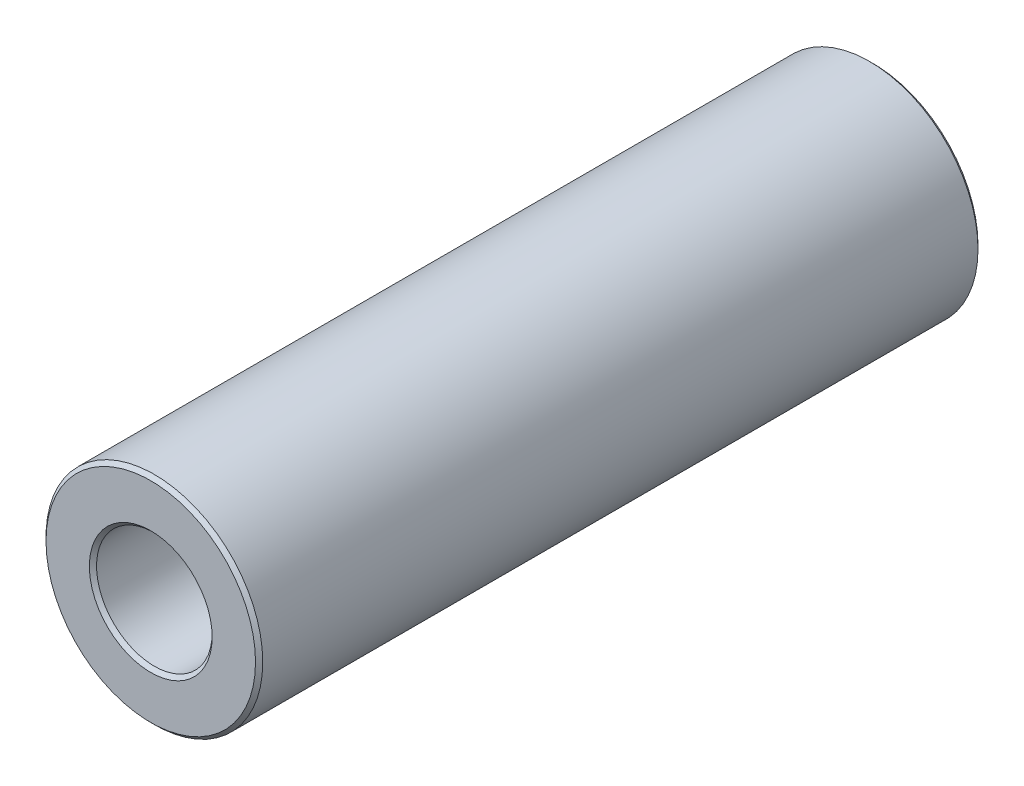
ISO-10303-21;
HEADER;
FILE_DESCRIPTION(('STEP AP214'),'2;1');
FILE_NAME('part.step','',(''),(''),'','','');
FILE_SCHEMA(('AUTOMOTIVE_DESIGN { 1 0 10303 214 1 1 1 1 }'));
ENDSEC;
DATA;
#1=APPLICATION_CONTEXT('core data for automotive mechanical design processes');
#2=APPLICATION_PROTOCOL_DEFINITION('international standard','automotive_design',2000,#1);
#3=PRODUCT_CONTEXT('',#1,'mechanical');
#4=PRODUCT('Part','Part','',(#3));
#5=PRODUCT_RELATED_PRODUCT_CATEGORY('part','',(#4));
#6=PRODUCT_DEFINITION_FORMATION('','',#4);
#7=PRODUCT_DEFINITION_CONTEXT('part definition',#1,'design');
#8=PRODUCT_DEFINITION('design','',#6,#7);
#9=PRODUCT_DEFINITION_SHAPE('','',#8);
#10=(LENGTH_UNIT() NAMED_UNIT(*) SI_UNIT(.MILLI.,.METRE.));
#11=(NAMED_UNIT(*) PLANE_ANGLE_UNIT() SI_UNIT($,.RADIAN.));
#12=(NAMED_UNIT(*) SI_UNIT($,.STERADIAN.) SOLID_ANGLE_UNIT());
#13=UNCERTAINTY_MEASURE_WITH_UNIT(LENGTH_MEASURE(1.E-05),#10,'distance_accuracy_value','');
#14=(GEOMETRIC_REPRESENTATION_CONTEXT(3) GLOBAL_UNCERTAINTY_ASSIGNED_CONTEXT((#13)) GLOBAL_UNIT_ASSIGNED_CONTEXT((#10,
#11,#12)) REPRESENTATION_CONTEXT('',''));
#15=CARTESIAN_POINT('',(0.,0.,0.));
#16=DIRECTION('',(0.,0.,1.));
#17=DIRECTION('',(1.,0.,0.));
#18=AXIS2_PLACEMENT_3D('',#15,#16,#17);
#19=CARTESIAN_POINT('',(0.,0.,10.));
#20=DIRECTION('',(0.,0.,1.));
#21=DIRECTION('',(1.,0.,0.));
#22=AXIS2_PLACEMENT_3D('',#19,#20,#21);
#23=PLANE('',#22);
#24=CARTESIAN_POINT('',(0.,0.,10.));
#25=DIRECTION('',(0.,0.,1.));
#26=DIRECTION('',(1.,0.,0.));
#27=AXIS2_PLACEMENT_3D('',#24,#25,#26);
#28=CIRCLE('',#27,1.70000000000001);
#29=CARTESIAN_POINT('',(1.70000000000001,0.,10.));
#30=VERTEX_POINT('',#29);
#31=EDGE_CURVE('E10',#30,#30,#28,.F.);
#32=ORIENTED_EDGE('',*,*,#31,.T.);
#33=EDGE_LOOP('',(#32));
#34=FACE_BOUND('',#33,.T.);
#35=CARTESIAN_POINT('',(0.,0.,10.));
#36=DIRECTION('',(0.,0.,1.));
#37=DIRECTION('',(1.,0.,0.));
#38=AXIS2_PLACEMENT_3D('',#35,#36,#37);
#39=CIRCLE('',#38,2.9);
#40=CARTESIAN_POINT('',(2.9,0.,10.));
#41=VERTEX_POINT('',#40);
#42=EDGE_CURVE('E45',#41,#41,#39,.T.);
#43=ORIENTED_EDGE('',*,*,#42,.T.);
#44=EDGE_LOOP('',(#43));
#45=FACE_BOUND('',#44,.T.);
#46=ADVANCED_FACE('F37',(#34,#45),#23,.T.);
#47=CARTESIAN_POINT('',(0.,0.,-10.));
#48=DIRECTION('',(0.,0.,1.));
#49=DIRECTION('',(1.,0.,0.));
#50=AXIS2_PLACEMENT_3D('',#47,#48,#49);
#51=PLANE('',#50);
#52=CARTESIAN_POINT('',(0.,0.,-10.));
#53=DIRECTION('',(0.,0.,1.));
#54=DIRECTION('',(1.,0.,0.));
#55=AXIS2_PLACEMENT_3D('',#52,#53,#54);
#56=CIRCLE('',#55,2.9);
#57=CARTESIAN_POINT('',(2.9,0.,-10.));
#58=VERTEX_POINT('',#57);
#59=EDGE_CURVE('E63',#58,#58,#56,.F.);
#60=ORIENTED_EDGE('',*,*,#59,.T.);
#61=EDGE_LOOP('',(#60));
#62=FACE_BOUND('',#61,.T.);
#63=CARTESIAN_POINT('',(0.,0.,-10.));
#64=DIRECTION('',(0.,0.,1.));
#65=DIRECTION('',(1.,0.,0.));
#66=AXIS2_PLACEMENT_3D('',#63,#64,#65);
#67=CIRCLE('',#66,1.7);
#68=CARTESIAN_POINT('',(1.7,0.,-10.));
#69=VERTEX_POINT('',#68);
#70=EDGE_CURVE('E67',#69,#69,#67,.T.);
#71=ORIENTED_EDGE('',*,*,#70,.T.);
#72=EDGE_LOOP('',(#71));
#73=FACE_BOUND('',#72,.T.);
#74=ADVANCED_FACE('F89',(#62,#73),#51,.F.);
#75=CARTESIAN_POINT('',(0.,0.,10.));
#76=DIRECTION('',(0.,0.,-1.));
#77=DIRECTION('',(-1.,0.,0.));
#78=AXIS2_PLACEMENT_3D('',#75,#76,#77);
#79=CYLINDRICAL_SURFACE('',#78,3.);
#80=CARTESIAN_POINT('',(0.,0.,-9.9));
#81=DIRECTION('',(0.,0.,1.));
#82=DIRECTION('',(1.,0.,0.));
#83=AXIS2_PLACEMENT_3D('',#80,#81,#82);
#84=CIRCLE('',#83,3.);
#85=CARTESIAN_POINT('',(3.,0.,-9.9));
#86=VERTEX_POINT('',#85);
#87=EDGE_CURVE('E70',#86,#86,#84,.T.);
#88=ORIENTED_EDGE('',*,*,#87,.T.);
#89=EDGE_LOOP('',(#88));
#90=FACE_BOUND('',#89,.T.);
#91=CARTESIAN_POINT('',(0.,0.,9.9));
#92=DIRECTION('',(0.,0.,1.));
#93=DIRECTION('',(1.,0.,0.));
#94=AXIS2_PLACEMENT_3D('',#91,#92,#93);
#95=CIRCLE('',#94,3.);
#96=CARTESIAN_POINT('',(3.,0.,9.9));
#97=VERTEX_POINT('',#96);
#98=EDGE_CURVE('E74',#97,#97,#95,.F.);
#99=ORIENTED_EDGE('',*,*,#98,.T.);
#100=EDGE_LOOP('',(#99));
#101=FACE_BOUND('',#100,.T.);
#102=ADVANCED_FACE('F78',(#90,#101),#79,.T.);
#103=CARTESIAN_POINT('',(0.,0.,10.));
#104=DIRECTION('',(0.,0.,-1.));
#105=DIRECTION('',(-1.,0.,0.));
#106=AXIS2_PLACEMENT_3D('',#103,#104,#105);
#107=CYLINDRICAL_SURFACE('',#106,1.6);
#108=CARTESIAN_POINT('',(0.,0.,-9.9));
#109=DIRECTION('',(0.,0.,1.));
#110=DIRECTION('',(1.,0.,0.));
#111=AXIS2_PLACEMENT_3D('',#108,#109,#110);
#112=CIRCLE('',#111,1.6);
#113=CARTESIAN_POINT('',(1.6,0.,-9.9));
#114=VERTEX_POINT('',#113);
#115=EDGE_CURVE('E52',#114,#114,#112,.F.);
#116=ORIENTED_EDGE('',*,*,#115,.T.);
#117=EDGE_LOOP('',(#116));
#118=FACE_BOUND('',#117,.T.);
#119=CARTESIAN_POINT('',(0.,0.,9.89999999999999));
#120=DIRECTION('',(0.,0.,1.));
#121=DIRECTION('',(1.,0.,0.));
#122=AXIS2_PLACEMENT_3D('',#119,#120,#121);
#123=CIRCLE('',#122,1.6);
#124=CARTESIAN_POINT('',(1.6,0.,9.89999999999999));
#125=VERTEX_POINT('',#124);
#126=EDGE_CURVE('E58',#125,#125,#123,.T.);
#127=ORIENTED_EDGE('',*,*,#126,.T.);
#128=EDGE_LOOP('',(#127));
#129=FACE_BOUND('',#128,.T.);
#130=ADVANCED_FACE('F97',(#118,#129),#107,.F.);
#131=CARTESIAN_POINT('',(0.,0.,-9.9));
#132=DIRECTION('',(0.,0.,1.));
#133=DIRECTION('',(1.,0.,0.));
#134=AXIS2_PLACEMENT_3D('',#131,#132,#133);
#135=CONICAL_SURFACE('',#134,3.,0.785398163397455);
#136=ORIENTED_EDGE('',*,*,#59,.F.);
#137=EDGE_LOOP('',(#136));
#138=FACE_BOUND('',#137,.T.);
#139=ORIENTED_EDGE('',*,*,#87,.F.);
#140=EDGE_LOOP('',(#139));
#141=FACE_BOUND('',#140,.T.);
#142=ADVANCED_FACE('F102',(#138,#141),#135,.T.);
#143=CARTESIAN_POINT('',(0.,0.,-10.));
#144=DIRECTION('',(0.,0.,-1.));
#145=DIRECTION('',(-1.,0.,0.));
#146=AXIS2_PLACEMENT_3D('',#143,#144,#145);
#147=CONICAL_SURFACE('',#146,1.7,0.78539816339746);
#148=ORIENTED_EDGE('',*,*,#115,.F.);
#149=EDGE_LOOP('',(#148));
#150=FACE_BOUND('',#149,.T.);
#151=ORIENTED_EDGE('',*,*,#70,.F.);
#152=EDGE_LOOP('',(#151));
#153=FACE_BOUND('',#152,.T.);
#154=ADVANCED_FACE('F86',(#150,#153),#147,.F.);
#155=CARTESIAN_POINT('',(0.,0.,9.89999999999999));
#156=DIRECTION('',(0.,0.,1.));
#157=DIRECTION('',(1.,0.,0.));
#158=AXIS2_PLACEMENT_3D('',#155,#156,#157);
#159=CONICAL_SURFACE('',#158,1.6,0.785398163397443);
#160=ORIENTED_EDGE('',*,*,#31,.F.);
#161=EDGE_LOOP('',(#160));
#162=FACE_BOUND('',#161,.T.);
#163=ORIENTED_EDGE('',*,*,#126,.F.);
#164=EDGE_LOOP('',(#163));
#165=FACE_BOUND('',#164,.T.);
#166=ADVANCED_FACE('F82',(#162,#165),#159,.F.);
#167=CARTESIAN_POINT('',(0.,0.,10.));
#168=DIRECTION('',(0.,0.,-1.));
#169=DIRECTION('',(-1.,0.,0.));
#170=AXIS2_PLACEMENT_3D('',#167,#168,#169);
#171=CONICAL_SURFACE('',#170,2.9,0.78539816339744);
#172=ORIENTED_EDGE('',*,*,#98,.F.);
#173=EDGE_LOOP('',(#172));
#174=FACE_BOUND('',#173,.T.);
#175=ORIENTED_EDGE('',*,*,#42,.F.);
#176=EDGE_LOOP('',(#175));
#177=FACE_BOUND('',#176,.T.);
#178=ADVANCED_FACE('F39',(#174,#177),#171,.T.);
#179=CLOSED_SHELL('',(#46,#74,#102,#130,#142,#154,#166,#178));
#180=MANIFOLD_SOLID_BREP('B2',#179);
#181=ADVANCED_BREP_SHAPE_REPRESENTATION('',(#18,#180),#14);
#182=SHAPE_DEFINITION_REPRESENTATION(#9,#181);
ENDSEC;
END-ISO-10303-21;
